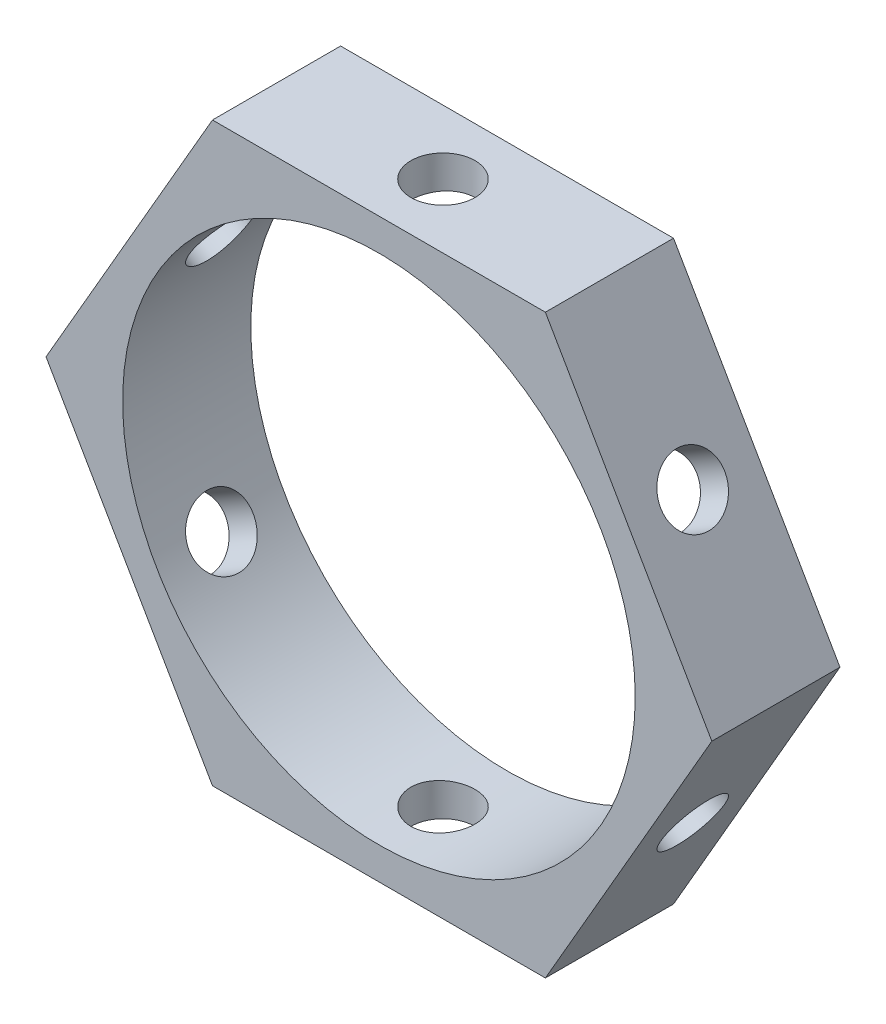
from build123d import *

# Parameters (mm, degrees)
SKETCH1_R          = 20
EXTRUDE1_DEPTH     = 10
SKETCH2_R          = 2.5
CUT_EXTRUDE1_DEPTH = 58.5
SKETCH3_R          = 2.5
CUT_EXTRUDE2_DEPTH = 53.91502624
SKETCH4_R          = 2.5
CUT_EXTRUDE3_DEPTH = 58.500000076


with BuildPart() as part:
    # Sketch1 → Extrude1 (new body)
    with BuildSketch(Plane.XY):
        Polygon((25.980762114, 0), (12.990381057, 22.5), (-12.990381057, 22.5), (-25.980762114, 0), (-12.990381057, -22.5), (12.990381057, -22.5), align=None)
        Circle(SKETCH1_R, mode=Mode.SUBTRACT)
    extrude(amount=EXTRUDE1_DEPTH)

    # Sketch2 → Cut-Extrude1 (cut, through all)
    with BuildSketch(Plane(origin=(19.485571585, 11.25, 0), x_dir=(0, 0, -1), z_dir=(0.8660254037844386, 0.5000000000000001, 0))):
        with Locations(Location((-5, 0, 0), (0, 0, 90))):
            Circle(SKETCH2_R)
    extrude(amount=-CUT_EXTRUDE1_DEPTH, mode=Mode.SUBTRACT)

    # Sketch3 → Cut-Extrude2 (cut, through all)
    with BuildSketch(Plane.XZ.offset(22.5)):
        with Locations(Location((0, 5, 0), (0, 0, 270))):
            Circle(SKETCH3_R)
    extrude(amount=-CUT_EXTRUDE2_DEPTH, mode=Mode.SUBTRACT)

    # Sketch4 → Cut-Extrude3 (cut, through all)
    with BuildSketch(Plane(origin=(19.485571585, -11.25, 0), x_dir=(0, 0, -1), z_dir=(0.8660254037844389, -0.4999999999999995, 0))):
        with Locations(Location((-5, 0, 0), (0, 0, 90))):
            Circle(SKETCH4_R)
    extrude(amount=-CUT_EXTRUDE3_DEPTH, mode=Mode.SUBTRACT)


solid = part.part
